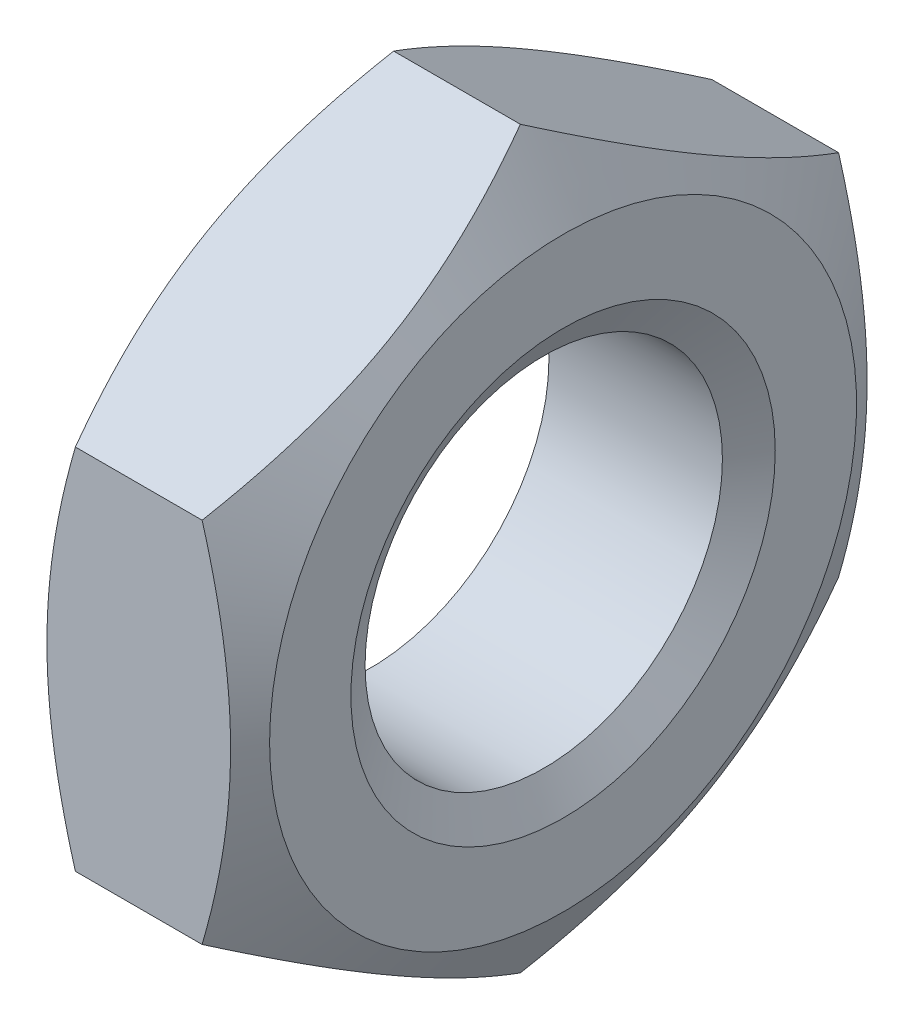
ISO-10303-21;
HEADER;
FILE_DESCRIPTION(('STEP AP214'),'2;1');
FILE_NAME('part.step','',(''),(''),'','','');
FILE_SCHEMA(('AUTOMOTIVE_DESIGN { 1 0 10303 214 1 1 1 1 }'));
ENDSEC;
DATA;
#1=APPLICATION_CONTEXT('core data for automotive mechanical design processes');
#2=APPLICATION_PROTOCOL_DEFINITION('international standard','automotive_design',2000,#1);
#3=PRODUCT_CONTEXT('',#1,'mechanical');
#4=PRODUCT('Part','Part','',(#3));
#5=PRODUCT_RELATED_PRODUCT_CATEGORY('part','',(#4));
#6=PRODUCT_DEFINITION_FORMATION('','',#4);
#7=PRODUCT_DEFINITION_CONTEXT('part definition',#1,'design');
#8=PRODUCT_DEFINITION('design','',#6,#7);
#9=PRODUCT_DEFINITION_SHAPE('','',#8);
#10=(LENGTH_UNIT() NAMED_UNIT(*) SI_UNIT(.MILLI.,.METRE.));
#11=(NAMED_UNIT(*) PLANE_ANGLE_UNIT() SI_UNIT($,.RADIAN.));
#12=(NAMED_UNIT(*) SI_UNIT($,.STERADIAN.) SOLID_ANGLE_UNIT());
#13=UNCERTAINTY_MEASURE_WITH_UNIT(LENGTH_MEASURE(1.E-05),#10,'distance_accuracy_value','');
#14=(GEOMETRIC_REPRESENTATION_CONTEXT(3) GLOBAL_UNCERTAINTY_ASSIGNED_CONTEXT((#13)) GLOBAL_UNIT_ASSIGNED_CONTEXT((#10,
#11,#12)) REPRESENTATION_CONTEXT('',''));
#15=CARTESIAN_POINT('',(0.,0.,0.));
#16=DIRECTION('',(0.,0.,1.));
#17=DIRECTION('',(1.,0.,0.));
#18=AXIS2_PLACEMENT_3D('',#15,#16,#17);
#19=CARTESIAN_POINT('',(0.,0.,0.));
#20=DIRECTION('',(1.,0.,0.));
#21=DIRECTION('',(0.,0.,-1.));
#22=AXIS2_PLACEMENT_3D('',#19,#20,#21);
#23=PLANE('',#22);
#24=CARTESIAN_POINT('',(5.6843418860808E-11,0.,0.));
#25=DIRECTION('',(-1.,0.,0.));
#26=DIRECTION('',(0.,0.,1.));
#27=AXIS2_PLACEMENT_3D('',#24,#25,#26);
#28=CIRCLE('',#27,6.00021528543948);
#29=CARTESIAN_POINT('',(5.6843418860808E-11,0.,6.00021528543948));
#30=VERTEX_POINT('',#29);
#31=EDGE_CURVE('E71',#30,#30,#28,.T.);
#32=ORIENTED_EDGE('',*,*,#31,.F.);
#33=EDGE_LOOP('',(#32));
#34=FACE_BOUND('',#33,.T.);
#35=CARTESIAN_POINT('',(0.,0.,0.));
#36=DIRECTION('',(1.,0.,0.));
#37=DIRECTION('',(0.,0.,-1.));
#38=AXIS2_PLACEMENT_3D('',#35,#36,#37);
#39=CIRCLE('',#38,8.3);
#40=CARTESIAN_POINT('',(0.,0.,-8.3));
#41=VERTEX_POINT('',#40);
#42=EDGE_CURVE('E21',#41,#41,#39,.F.);
#43=ORIENTED_EDGE('',*,*,#42,.T.);
#44=EDGE_LOOP('',(#43));
#45=FACE_BOUND('',#44,.T.);
#46=ADVANCED_FACE('F17',(#34,#45),#23,.F.);
#47=CARTESIAN_POINT('',(0.,0.,0.));
#48=DIRECTION('',(1.,0.,0.));
#49=DIRECTION('',(0.,0.,-1.));
#50=AXIS2_PLACEMENT_3D('',#47,#48,#49);
#51=CONICAL_SURFACE('',#50,8.3,1.0471975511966);
#52=CARTESIAN_POINT('',(1.2079927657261,-10.3923048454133,0.));
#53=CARTESIAN_POINT('',(1.14206327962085,-10.2781018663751,-0.197805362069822));
#54=CARTESIAN_POINT('',(1.07912551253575,-10.1634534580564,-0.396382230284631));
#55=CARTESIAN_POINT('',(0.960058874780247,-9.93322560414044,-0.795148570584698));
#56=CARTESIAN_POINT('',(0.903932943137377,-9.81764577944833,-0.995338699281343));
#57=CARTESIAN_POINT('',(0.799250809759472,-9.58534066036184,-1.39770296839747));
#58=CARTESIAN_POINT('',(0.750712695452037,-9.46861331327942,-1.59988066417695));
#59=CARTESIAN_POINT('',(0.662256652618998,-9.23436475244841,-2.00561107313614));
#60=CARTESIAN_POINT('',(0.622336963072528,-9.11684370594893,-2.20916349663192));
#61=CARTESIAN_POINT('',(0.552802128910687,-8.88398728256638,-2.61248265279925));
#62=CARTESIAN_POINT('',(0.522958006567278,-8.76866910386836,-2.81221959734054));
#63=CARTESIAN_POINT('',(0.472919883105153,-8.53751681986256,-3.21258709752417));
#64=CARTESIAN_POINT('',(0.452725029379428,-8.42168276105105,-3.41321757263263));
#65=CARTESIAN_POINT('',(0.422489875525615,-8.18981377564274,-3.81482643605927));
#66=CARTESIAN_POINT('',(0.412438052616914,-8.07377922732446,-4.01580416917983));
#67=CARTESIAN_POINT('',(0.402706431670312,-7.84160340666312,-4.41794448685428));
#68=CARTESIAN_POINT('',(0.403026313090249,-7.72546213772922,-4.6191070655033));
#69=CARTESIAN_POINT('',(0.413315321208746,-7.50834005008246,-4.99517355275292));
#70=CARTESIAN_POINT('',(0.422029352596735,-7.40734390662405,-5.1701040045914));
#71=CARTESIAN_POINT('',(0.447131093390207,-7.20558819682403,-5.51955514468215));
#72=CARTESIAN_POINT('',(0.463519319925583,-7.10482864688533,-5.69407580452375));
#73=CARTESIAN_POINT('',(0.523807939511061,-6.80294009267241,-6.21696211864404));
#74=CARTESIAN_POINT('',(0.578824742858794,-6.60234542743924,-6.56440227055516));
#75=CARTESIAN_POINT('',(0.716364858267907,-6.19902855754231,-7.26296758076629));
#76=CARTESIAN_POINT('',(0.799471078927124,-5.99635781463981,-7.61400360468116));
#77=CARTESIAN_POINT('',(0.988086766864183,-5.59403831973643,-8.31084141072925));
#78=CARTESIAN_POINT('',(1.09355194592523,-5.39438441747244,-8.65665211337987));
#79=CARTESIAN_POINT('',(1.20799276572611,-5.19615242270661,-9.00000000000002));
#80=B_SPLINE_CURVE_WITH_KNOTS('',3,(#52,#53,#54,#55,#56,#57,#58,#59,#60,#61,#62,#63,#64,#65,#66,
#67,#68,#69,#70,#71,#72,#73,#74,#75,#76,#77,#78,#79),.UNSPECIFIED.,.F.,.F.,(4,2,2,2,2,2,2,2,2,2,
2,2,2,4),(0.,0.713211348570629,1.42672933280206,2.14192304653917,2.85697048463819,
3.55445829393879,4.25188446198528,4.9485174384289,5.64512888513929,6.25151815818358,
6.8579482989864,8.07167214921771,9.31231057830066,10.5505141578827),.UNSPECIFIED.);
#81=CARTESIAN_POINT('',(1.2079927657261,-10.3923048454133,0.));
#82=VERTEX_POINT('',#81);
#83=CARTESIAN_POINT('',(1.20799276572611,-5.1961524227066,-9.00000000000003));
#84=VERTEX_POINT('',#83);
#85=EDGE_CURVE('E70',#82,#84,#80,.T.);
#86=ORIENTED_EDGE('',*,*,#85,.F.);
#87=CARTESIAN_POINT('',(1.2079927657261,-5.19615242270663,9.));
#88=CARTESIAN_POINT('',(1.14206327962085,-5.3103554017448,8.80219463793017));
#89=CARTESIAN_POINT('',(1.07912551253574,-5.42500381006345,8.60361776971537));
#90=CARTESIAN_POINT('',(0.960058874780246,-5.65523166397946,8.2048514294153));
#91=CARTESIAN_POINT('',(0.903932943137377,-5.77081148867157,8.00466130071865));
#92=CARTESIAN_POINT('',(0.799250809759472,-6.00311660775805,7.60229703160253));
#93=CARTESIAN_POINT('',(0.750712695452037,-6.11984395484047,7.40011933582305));
#94=CARTESIAN_POINT('',(0.662256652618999,-6.35409251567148,6.99438892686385));
#95=CARTESIAN_POINT('',(0.622336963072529,-6.47161356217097,6.79083650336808));
#96=CARTESIAN_POINT('',(0.552802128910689,-6.70446998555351,6.38751734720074));
#97=CARTESIAN_POINT('',(0.52295800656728,-6.81978816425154,6.18778040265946));
#98=CARTESIAN_POINT('',(0.472919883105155,-7.05094044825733,5.78741290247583));
#99=CARTESIAN_POINT('',(0.45272502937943,-7.16677450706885,5.58678242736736));
#100=CARTESIAN_POINT('',(0.422489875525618,-7.39864349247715,5.18517356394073));
#101=CARTESIAN_POINT('',(0.412438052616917,-7.51467804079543,4.98419583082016));
#102=CARTESIAN_POINT('',(0.402706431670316,-7.74685386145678,4.58205551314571));
#103=CARTESIAN_POINT('',(0.403026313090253,-7.86299513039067,4.38089293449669));
#104=CARTESIAN_POINT('',(0.41331532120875,-8.08011721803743,4.00482644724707));
#105=CARTESIAN_POINT('',(0.42202935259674,-8.18111336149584,3.8298959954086));
#106=CARTESIAN_POINT('',(0.447131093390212,-8.38286907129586,3.48044485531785));
#107=CARTESIAN_POINT('',(0.463519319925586,-8.48362862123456,3.30592419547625));
#108=CARTESIAN_POINT('',(0.523807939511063,-8.78551717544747,2.78303788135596));
#109=CARTESIAN_POINT('',(0.578824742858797,-8.98611184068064,2.43559772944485));
#110=CARTESIAN_POINT('',(0.716364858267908,-9.38942871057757,1.73703241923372));
#111=CARTESIAN_POINT('',(0.799471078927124,-9.59209945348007,1.38599639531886));
#112=CARTESIAN_POINT('',(0.98808676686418,-9.99441894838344,0.689158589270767));
#113=CARTESIAN_POINT('',(1.09355194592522,-10.1940728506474,0.343347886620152));
#114=CARTESIAN_POINT('',(1.2079927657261,-10.3923048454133,0.));
#115=B_SPLINE_CURVE_WITH_KNOTS('',3,(#87,#88,#89,#90,#91,#92,#93,#94,#95,#96,#97,#98,#99,#100,
#101,#102,#103,#104,#105,#106,#107,#108,#109,#110,#111,#112,#113,#114),.UNSPECIFIED.,.F.,.F.,(4,
2,2,2,2,2,2,2,2,2,2,2,2,4),(0.,0.71321134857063,1.42672933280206,2.14192304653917,
2.85697048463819,3.55445829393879,4.25188446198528,4.9485174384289,5.64512888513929,
6.25151815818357,6.85794829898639,8.07167214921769,9.31231057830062,10.5505141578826),.UNSPECIFIED.);
#116=CARTESIAN_POINT('',(1.2079927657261,-5.19615242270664,9.));
#117=VERTEX_POINT('',#116);
#118=EDGE_CURVE('E62',#117,#82,#115,.T.);
#119=ORIENTED_EDGE('',*,*,#118,.F.);
#120=CARTESIAN_POINT('',(1.2079927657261,5.19615242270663,9.));
#121=CARTESIAN_POINT('',(1.14206327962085,4.9677464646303,9.));
#122=CARTESIAN_POINT('',(1.07912551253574,4.738449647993,9.));
#123=CARTESIAN_POINT('',(0.960058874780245,4.27799394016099,9.));
#124=CARTESIAN_POINT('',(0.903932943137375,4.04683429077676,9.));
#125=CARTESIAN_POINT('',(0.799250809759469,3.5822240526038,9.));
#126=CARTESIAN_POINT('',(0.750712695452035,3.34876935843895,9.));
#127=CARTESIAN_POINT('',(0.662256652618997,2.88027223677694,9.));
#128=CARTESIAN_POINT('',(0.622336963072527,2.64523014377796,9.));
#129=CARTESIAN_POINT('',(0.552802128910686,2.17951729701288,9.));
#130=CARTESIAN_POINT('',(0.522958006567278,1.94888093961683,9.));
#131=CARTESIAN_POINT('',(0.472919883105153,1.48657637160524,9.));
#132=CARTESIAN_POINT('',(0.452725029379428,1.25490825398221,9.));
#133=CARTESIAN_POINT('',(0.422489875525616,0.79117028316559,9.));
#134=CARTESIAN_POINT('',(0.412438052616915,0.559101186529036,9.));
#135=CARTESIAN_POINT('',(0.402706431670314,0.0947495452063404,9.));
#136=CARTESIAN_POINT('',(0.403026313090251,-0.137532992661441,9.));
#137=CARTESIAN_POINT('',(0.413315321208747,-0.571777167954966,9.));
#138=CARTESIAN_POINT('',(0.422029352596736,-0.773769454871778,9.));
#139=CARTESIAN_POINT('',(0.447131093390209,-1.17728087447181,9.));
#140=CARTESIAN_POINT('',(0.463519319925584,-1.37879997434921,9.));
#141=CARTESIAN_POINT('',(0.523807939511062,-1.98257708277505,9.));
#142=CARTESIAN_POINT('',(0.578824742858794,-2.38376641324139,9.));
#143=CARTESIAN_POINT('',(0.716364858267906,-3.19040015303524,9.));
#144=CARTESIAN_POINT('',(0.799471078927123,-3.59574163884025,9.));
#145=CARTESIAN_POINT('',(0.988086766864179,-4.400380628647,9.));
#146=CARTESIAN_POINT('',(1.09355194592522,-4.79968843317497,9.));
#147=CARTESIAN_POINT('',(1.2079927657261,-5.19615242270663,9.));
#148=B_SPLINE_CURVE_WITH_KNOTS('',3,(#120,#121,#122,#123,#124,#125,#126,#127,#128,#129,#130,
#131,#132,#133,#134,#135,#136,#137,#138,#139,#140,#141,#142,#143,#144,#145,#146,#147),
.UNSPECIFIED.,.F.,.F.,(4,2,2,2,2,2,2,2,2,2,2,2,2,4),(0.,0.713211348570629,1.42672933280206,
2.14192304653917,2.85697048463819,3.55445829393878,4.25188446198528,4.9485174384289,
5.64512888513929,6.25151815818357,6.85794829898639,8.07167214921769,9.31231057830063,
10.5505141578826),.UNSPECIFIED.);
#149=CARTESIAN_POINT('',(1.2079927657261,5.19615242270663,8.99999999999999));
#150=VERTEX_POINT('',#149);
#151=EDGE_CURVE('E67',#150,#117,#148,.T.);
#152=ORIENTED_EDGE('',*,*,#151,.F.);
#153=CARTESIAN_POINT('',(1.2079927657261,10.3923048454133,0.));
#154=CARTESIAN_POINT('',(1.14206327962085,10.2781018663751,0.197805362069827));
#155=CARTESIAN_POINT('',(1.07912551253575,10.1634534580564,0.396382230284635));
#156=CARTESIAN_POINT('',(0.960058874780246,9.93322560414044,0.795148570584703));
#157=CARTESIAN_POINT('',(0.903932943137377,9.81764577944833,0.995338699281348));
#158=CARTESIAN_POINT('',(0.799250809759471,9.58534066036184,1.39770296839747));
#159=CARTESIAN_POINT('',(0.750712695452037,9.46861331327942,1.59988066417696));
#160=CARTESIAN_POINT('',(0.662256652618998,9.23436475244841,2.00561107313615));
#161=CARTESIAN_POINT('',(0.622336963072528,9.11684370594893,2.20916349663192));
#162=CARTESIAN_POINT('',(0.552802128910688,8.88398728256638,2.61248265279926));
#163=CARTESIAN_POINT('',(0.522958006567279,8.76866910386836,2.81221959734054));
#164=CARTESIAN_POINT('',(0.472919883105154,8.53751681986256,3.21258709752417));
#165=CARTESIAN_POINT('',(0.452725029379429,8.42168276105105,3.41321757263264));
#166=CARTESIAN_POINT('',(0.422489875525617,8.18981377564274,3.81482643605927));
#167=CARTESIAN_POINT('',(0.412438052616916,8.07377922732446,4.01580416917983));
#168=CARTESIAN_POINT('',(0.402706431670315,7.84160340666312,4.41794448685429));
#169=CARTESIAN_POINT('',(0.403026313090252,7.72546213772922,4.61910706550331));
#170=CARTESIAN_POINT('',(0.413315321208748,7.50834005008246,4.99517355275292));
#171=CARTESIAN_POINT('',(0.422029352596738,7.40734390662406,5.1701040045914));
#172=CARTESIAN_POINT('',(0.44713109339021,7.20558819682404,5.51955514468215));
#173=CARTESIAN_POINT('',(0.463519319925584,7.10482864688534,5.69407580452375));
#174=CARTESIAN_POINT('',(0.523807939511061,6.80294009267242,6.21696211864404));
#175=CARTESIAN_POINT('',(0.578824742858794,6.60234542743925,6.56440227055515));
#176=CARTESIAN_POINT('',(0.716364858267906,6.19902855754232,7.26296758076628));
#177=CARTESIAN_POINT('',(0.799471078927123,5.99635781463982,7.61400360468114));
#178=CARTESIAN_POINT('',(0.98808676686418,5.59403831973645,8.31084141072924));
#179=CARTESIAN_POINT('',(1.09355194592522,5.39438441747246,8.65665211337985));
#180=CARTESIAN_POINT('',(1.2079927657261,5.19615242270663,9.));
#181=B_SPLINE_CURVE_WITH_KNOTS('',3,(#153,#154,#155,#156,#157,#158,#159,#160,#161,#162,#163,
#164,#165,#166,#167,#168,#169,#170,#171,#172,#173,#174,#175,#176,#177,#178,#179,#180),
.UNSPECIFIED.,.F.,.F.,(4,2,2,2,2,2,2,2,2,2,2,2,2,4),(0.,0.713211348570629,1.42672933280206,
2.14192304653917,2.85697048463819,3.55445829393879,4.25188446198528,4.9485174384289,
5.64512888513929,6.25151815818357,6.85794829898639,8.07167214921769,9.31231057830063,
10.5505141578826),.UNSPECIFIED.);
#182=CARTESIAN_POINT('',(1.2079927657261,10.3923048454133,0.));
#183=VERTEX_POINT('',#182);
#184=EDGE_CURVE('E81',#183,#150,#181,.T.);
#185=ORIENTED_EDGE('',*,*,#184,.F.);
#186=CARTESIAN_POINT('',(1.20799276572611,5.19615242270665,-9.));
#187=CARTESIAN_POINT('',(1.14206327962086,5.31035540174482,-8.80219463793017));
#188=CARTESIAN_POINT('',(1.07912551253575,5.42500381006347,-8.60361776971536));
#189=CARTESIAN_POINT('',(0.960058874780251,5.65523166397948,-8.20485142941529));
#190=CARTESIAN_POINT('',(0.903932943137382,5.77081148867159,-8.00466130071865));
#191=CARTESIAN_POINT('',(0.799250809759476,6.00311660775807,-7.60229703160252));
#192=CARTESIAN_POINT('',(0.750712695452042,6.11984395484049,-7.40011933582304));
#193=CARTESIAN_POINT('',(0.662256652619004,6.3540925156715,-6.99438892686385));
#194=CARTESIAN_POINT('',(0.622336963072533,6.47161356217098,-6.79083650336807));
#195=CARTESIAN_POINT('',(0.552802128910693,6.70446998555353,-6.38751734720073));
#196=CARTESIAN_POINT('',(0.522958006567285,6.81978816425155,-6.18778040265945));
#197=CARTESIAN_POINT('',(0.47291988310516,7.05094044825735,-5.78741290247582));
#198=CARTESIAN_POINT('',(0.452725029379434,7.16677450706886,-5.58678242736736));
#199=CARTESIAN_POINT('',(0.422489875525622,7.39864349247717,-5.18517356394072));
#200=CARTESIAN_POINT('',(0.412438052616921,7.51467804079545,-4.98419583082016));
#201=CARTESIAN_POINT('',(0.402706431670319,7.74685386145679,-4.5820555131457));
#202=CARTESIAN_POINT('',(0.403026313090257,7.86299513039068,-4.38089293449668));
#203=CARTESIAN_POINT('',(0.413315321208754,8.08011721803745,-4.00482644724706));
#204=CARTESIAN_POINT('',(0.422029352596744,8.18111336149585,-3.82989599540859));
#205=CARTESIAN_POINT('',(0.447131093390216,8.38286907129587,-3.48044485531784));
#206=CARTESIAN_POINT('',(0.46351931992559,8.48362862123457,-3.30592419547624));
#207=CARTESIAN_POINT('',(0.523807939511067,8.78551717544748,-2.78303788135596));
#208=CARTESIAN_POINT('',(0.5788247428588,8.98611184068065,-2.43559772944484));
#209=CARTESIAN_POINT('',(0.716364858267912,9.38942871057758,-1.73703241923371));
#210=CARTESIAN_POINT('',(0.799471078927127,9.59209945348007,-1.38599639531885));
#211=CARTESIAN_POINT('',(0.988086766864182,9.99441894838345,-0.68915858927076));
#212=CARTESIAN_POINT('',(1.09355194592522,10.1940728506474,-0.343347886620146));
#213=CARTESIAN_POINT('',(1.2079927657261,10.3923048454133,0.));
#214=B_SPLINE_CURVE_WITH_KNOTS('',3,(#186,#187,#188,#189,#190,#191,#192,#193,#194,#195,#196,
#197,#198,#199,#200,#201,#202,#203,#204,#205,#206,#207,#208,#209,#210,#211,#212,#213),
.UNSPECIFIED.,.F.,.F.,(4,2,2,2,2,2,2,2,2,2,2,2,2,4),(0.,0.713211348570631,1.42672933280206,
2.14192304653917,2.85697048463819,3.55445829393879,4.25188446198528,4.9485174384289,
5.64512888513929,6.25151815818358,6.85794829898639,8.07167214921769,9.31231057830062,
10.5505141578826),.UNSPECIFIED.);
#215=CARTESIAN_POINT('',(1.20799276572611,5.19615242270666,-9.));
#216=VERTEX_POINT('',#215);
#217=EDGE_CURVE('E175',#216,#183,#214,.T.);
#218=ORIENTED_EDGE('',*,*,#217,.F.);
#219=CARTESIAN_POINT('',(1.20799276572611,-5.1961524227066,-9.00000000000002));
#220=CARTESIAN_POINT('',(1.14206327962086,-4.96774646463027,-9.00000000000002));
#221=CARTESIAN_POINT('',(1.07912551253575,-4.73844964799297,-9.00000000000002));
#222=CARTESIAN_POINT('',(0.960058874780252,-4.27799394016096,-9.00000000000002));
#223=CARTESIAN_POINT('',(0.903932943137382,-4.04683429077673,-9.00000000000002));
#224=CARTESIAN_POINT('',(0.799250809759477,-3.58222405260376,-9.00000000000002));
#225=CARTESIAN_POINT('',(0.750712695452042,-3.34876935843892,-9.00000000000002));
#226=CARTESIAN_POINT('',(0.662256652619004,-2.8802722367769,-9.00000000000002));
#227=CARTESIAN_POINT('',(0.622336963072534,-2.64523014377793,-9.00000000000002));
#228=CARTESIAN_POINT('',(0.552802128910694,-2.17951729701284,-9.00000000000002));
#229=CARTESIAN_POINT('',(0.522958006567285,-1.94888093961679,-9.00000000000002));
#230=CARTESIAN_POINT('',(0.472919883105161,-1.4865763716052,-9.00000000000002));
#231=CARTESIAN_POINT('',(0.452725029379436,-1.25490825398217,-9.00000000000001));
#232=CARTESIAN_POINT('',(0.422489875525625,-0.791170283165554,-9.00000000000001));
#233=CARTESIAN_POINT('',(0.412438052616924,-0.559101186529,-9.00000000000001));
#234=CARTESIAN_POINT('',(0.402706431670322,-0.0947495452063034,-9.00000000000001));
#235=CARTESIAN_POINT('',(0.40302631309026,0.137532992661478,-9.00000000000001));
#236=CARTESIAN_POINT('',(0.413315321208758,0.571777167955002,-9.00000000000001));
#237=CARTESIAN_POINT('',(0.422029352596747,0.773769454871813,-9.00000000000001));
#238=CARTESIAN_POINT('',(0.447131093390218,1.17728087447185,-9.00000000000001));
#239=CARTESIAN_POINT('',(0.463519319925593,1.37879997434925,-9.00000000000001));
#240=CARTESIAN_POINT('',(0.52380793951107,1.98257708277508,-9.00000000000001));
#241=CARTESIAN_POINT('',(0.578824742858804,2.38376641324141,-9.00000000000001));
#242=CARTESIAN_POINT('',(0.716364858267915,3.19040015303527,-9.));
#243=CARTESIAN_POINT('',(0.799471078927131,3.59574163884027,-9.));
#244=CARTESIAN_POINT('',(0.988086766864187,4.40038062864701,-9.));
#245=CARTESIAN_POINT('',(1.09355194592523,4.79968843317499,-9.));
#246=CARTESIAN_POINT('',(1.20799276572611,5.19615242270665,-9.));
#247=B_SPLINE_CURVE_WITH_KNOTS('',3,(#219,#220,#221,#222,#223,#224,#225,#226,#227,#228,#229,
#230,#231,#232,#233,#234,#235,#236,#237,#238,#239,#240,#241,#242,#243,#244,#245,#246),
.UNSPECIFIED.,.F.,.F.,(4,2,2,2,2,2,2,2,2,2,2,2,2,4),(0.,0.713211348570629,1.42672933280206,
2.14192304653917,2.85697048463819,3.55445829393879,4.25188446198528,4.94851743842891,
5.64512888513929,6.25151815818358,6.85794829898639,8.07167214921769,9.31231057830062,
10.5505141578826),.UNSPECIFIED.);
#248=EDGE_CURVE('E169',#84,#216,#247,.T.);
#249=ORIENTED_EDGE('',*,*,#248,.F.);
#250=EDGE_LOOP('',(#86,#119,#152,#185,#218,#249));
#251=FACE_BOUND('',#250,.T.);
#252=ORIENTED_EDGE('',*,*,#42,.F.);
#253=EDGE_LOOP('',(#252));
#254=FACE_BOUND('',#253,.T.);
#255=ADVANCED_FACE('F64',(#251,#254),#51,.T.);
#256=CARTESIAN_POINT('',(0.54687500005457,0.,0.));
#257=DIRECTION('',(-1.,0.,0.));
#258=DIRECTION('',(0.,0.,1.));
#259=AXIS2_PLACEMENT_3D('',#256,#257,#258);
#260=CONICAL_SURFACE('',#259,5.05300000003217,1.04719755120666);
#261=ORIENTED_EDGE('',*,*,#31,.T.);
#262=EDGE_LOOP('',(#261));
#263=FACE_BOUND('',#262,.T.);
#264=CARTESIAN_POINT('',(0.546874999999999,0.,0.));
#265=DIRECTION('',(1.,0.,0.));
#266=DIRECTION('',(0.,0.,-1.));
#267=AXIS2_PLACEMENT_3D('',#264,#265,#266);
#268=CIRCLE('',#267,5.053);
#269=CARTESIAN_POINT('',(0.546874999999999,0.,-5.053));
#270=VERTEX_POINT('',#269);
#271=EDGE_CURVE('E208',#270,#270,#268,.T.);
#272=ORIENTED_EDGE('',*,*,#271,.T.);
#273=EDGE_LOOP('',(#272));
#274=FACE_BOUND('',#273,.T.);
#275=ADVANCED_FACE('F217',(#263,#274),#260,.F.);
#276=CARTESIAN_POINT('',(0.,-10.3923048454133,0.));
#277=DIRECTION('',(0.,-0.866025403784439,0.5));
#278=DIRECTION('',(0.,-0.5,-0.866025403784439));
#279=AXIS2_PLACEMENT_3D('',#276,#277,#278);
#280=PLANE('',#279);
#281=CARTESIAN_POINT('',(4.7920072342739,-10.3923048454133,0.));
#282=CARTESIAN_POINT('',(4.8579367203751,-10.2781018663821,0.197805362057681));
#283=CARTESIAN_POINT('',(4.92087448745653,-10.1634534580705,0.39638223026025));
#284=CARTESIAN_POINT('',(5.03994112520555,-9.93322560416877,0.795148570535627));
#285=CARTESIAN_POINT('',(5.09606705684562,-9.81764577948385,0.995338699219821));
#286=CARTESIAN_POINT('',(5.20074919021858,-9.58534066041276,1.39770296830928));
#287=CARTESIAN_POINT('',(5.24928730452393,-9.46861331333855,1.59988066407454));
#288=CARTESIAN_POINT('',(5.33774334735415,-9.23436475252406,2.00561107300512));
#289=CARTESIAN_POINT('',(5.37766303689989,-9.11684370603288,2.20916349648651));
#290=CARTESIAN_POINT('',(5.44719787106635,-8.88398728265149,2.61248265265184));
#291=CARTESIAN_POINT('',(5.47704199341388,-8.76866910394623,2.81221959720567));
#292=CARTESIAN_POINT('',(5.52708011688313,-8.53751681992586,3.21258709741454));
#293=CARTESIAN_POINT('',(5.54727497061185,-8.42168276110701,3.41321757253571));
#294=CARTESIAN_POINT('',(5.57751012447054,-8.18981377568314,3.8148264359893));
#295=CARTESIAN_POINT('',(5.58756194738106,-8.07377922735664,4.01580416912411));
#296=CARTESIAN_POINT('',(5.5972935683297,-7.841603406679,4.41794448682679));
#297=CARTESIAN_POINT('',(5.59697368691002,-7.72546213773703,4.61910706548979));
#298=CARTESIAN_POINT('',(5.58668467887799,-7.50834005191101,4.99517354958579));
#299=CARTESIAN_POINT('',(5.57797064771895,-7.40734391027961,5.1701039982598));
#300=CARTESIAN_POINT('',(5.55286890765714,-7.20558820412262,5.51955513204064));
#301=CARTESIAN_POINT('',(5.53648068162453,-7.10482865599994,5.6940757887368));
#302=CARTESIAN_POINT('',(5.47619206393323,-6.80294010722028,6.21696209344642));
#303=CARTESIAN_POINT('',(5.42117526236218,-6.60234544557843,6.56440223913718));
#304=CARTESIAN_POINT('',(5.28363515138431,-6.19902858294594,7.26296753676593));
#305=CARTESIAN_POINT('',(5.20052893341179,-5.99635784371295,7.61400355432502));
#306=CARTESIAN_POINT('',(5.01191325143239,-5.59403835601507,8.31084134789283));
#307=CARTESIAN_POINT('',(4.90644807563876,-5.39438445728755,8.6566520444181));
#308=CARTESIAN_POINT('',(4.7920072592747,-5.1961524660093,8.99999992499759));
#309=B_SPLINE_CURVE_WITH_KNOTS('',3,(#281,#282,#283,#284,#285,#286,#287,#288,#289,#290,#291,
#292,#293,#294,#295,#296,#297,#298,#299,#300,#301,#302,#303,#304,#305,#306,#307,#308),
.UNSPECIFIED.,.F.,.F.,(4,2,2,2,2,2,2,2,2,2,2,2,2,4),(0.,0.713211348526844,1.4267293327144,
2.14192304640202,2.8569704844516,3.55445829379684,4.25188446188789,4.94851743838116,
5.64512888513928,6.25151814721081,6.85794827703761,8.07167210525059,9.31231051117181,
10.5505140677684),.UNSPECIFIED.);
#310=CARTESIAN_POINT('',(4.7920072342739,-10.3923048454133,0.));
#311=VERTEX_POINT('',#310);
#312=CARTESIAN_POINT('',(4.7920072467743,-5.19615244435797,8.99999996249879));
#313=VERTEX_POINT('',#312);
#314=EDGE_CURVE('E77',#311,#313,#309,.T.);
#315=ORIENTED_EDGE('',*,*,#314,.T.);
#316=DIRECTION('',(1.,0.,0.));
#317=VECTOR('',#316,1.);
#318=CARTESIAN_POINT('',(0.,-5.19615242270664,9.));
#319=LINE('',#318,#317);
#320=EDGE_CURVE('E74',#117,#313,#319,.T.);
#321=ORIENTED_EDGE('',*,*,#320,.F.);
#322=ORIENTED_EDGE('',*,*,#118,.T.);
#323=DIRECTION('',(1.,0.,0.));
#324=VECTOR('',#323,1.);
#325=CARTESIAN_POINT('',(0.,-10.3923048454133,0.));
#326=LINE('',#325,#324);
#327=EDGE_CURVE('E36',#311,#82,#326,.F.);
#328=ORIENTED_EDGE('',*,*,#327,.F.);
#329=EDGE_LOOP('',(#315,#321,#322,#328));
#330=FACE_BOUND('',#329,.T.);
#331=ADVANCED_FACE('F75',(#330),#280,.T.);
#332=CARTESIAN_POINT('',(0.,-5.19615242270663,9.));
#333=DIRECTION('',(0.,0.,1.));
#334=DIRECTION('',(1.,0.,0.));
#335=AXIS2_PLACEMENT_3D('',#332,#333,#334);
#336=PLANE('',#335);
#337=CARTESIAN_POINT('',(4.79200722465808,-5.1961524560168,9.));
#338=CARTESIAN_POINT('',(4.8579367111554,-4.96774649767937,9.));
#339=CARTESIAN_POINT('',(4.92087447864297,-4.73844968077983,9.));
#340=CARTESIAN_POINT('',(5.0399411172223,-4.27799397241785,9.));
#341=CARTESIAN_POINT('',(5.09606704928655,-4.04683432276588,9.));
#342=CARTESIAN_POINT('',(5.20074918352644,-3.58222408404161,9.));
#343=CARTESIAN_POINT('',(5.2492872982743,-3.34876938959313,9.));
#344=CARTESIAN_POINT('',(5.33774334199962,-2.88027226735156,9.));
#345=CARTESIAN_POINT('',(5.37766303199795,-2.64523017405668,9.));
#346=CARTESIAN_POINT('',(5.44719786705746,-2.17951732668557,9.));
#347=CARTESIAN_POINT('',(5.47704198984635,-1.94888096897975,9.));
#348=CARTESIAN_POINT('',(5.52708011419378,-1.48657640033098,9.));
#349=CARTESIAN_POINT('',(5.54727496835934,-1.25490828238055,9.));
#350=CARTESIAN_POINT('',(5.57751012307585,-0.791170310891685,9.));
#351=CARTESIAN_POINT('',(5.5875619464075,-0.559101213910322,9.));
#352=CARTESIAN_POINT('',(5.59729356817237,-0.0947495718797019,9.));
#353=CARTESIAN_POINT('',(5.59697368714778,0.137532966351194,9.));
#354=CARTESIAN_POINT('',(5.58668467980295,0.571777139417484,9.));
#355=CARTESIAN_POINT('',(5.57797064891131,0.77376942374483,9.));
#356=CARTESIAN_POINT('',(5.55286890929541,1.17728083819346,9.));
#357=CARTESIAN_POINT('',(5.53648068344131,1.37879993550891,9.));
#358=CARTESIAN_POINT('',(5.47619206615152,1.98257703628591,9.));
#359=CARTESIAN_POINT('',(5.42117526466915,2.38376636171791,9.));
#360=CARTESIAN_POINT('',(5.28363515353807,3.19040009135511,9.));
#361=CARTESIAN_POINT('',(5.20052893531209,3.59574157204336,9.));
#362=CARTESIAN_POINT('',(5.01191325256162,4.40038055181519,9.));
#363=CARTESIAN_POINT('',(4.90644807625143,4.79968835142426,9.));
#364=CARTESIAN_POINT('',(4.7920072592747,5.1961523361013,9.));
#365=B_SPLINE_CURVE_WITH_KNOTS('',3,(#337,#338,#339,#340,#341,#342,#343,#344,#345,#346,#347,
#348,#349,#350,#351,#352,#353,#354,#355,#356,#357,#358,#359,#360,#361,#362,#363,#364),
.UNSPECIFIED.,.F.,.F.,(4,2,2,2,2,2,2,2,2,2,2,2,2,4),(0.,0.713211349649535,1.42672933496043,
2.14192304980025,2.85697048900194,3.55445829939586,4.25188446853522,4.9485174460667,
5.64512889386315,6.25151815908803,6.85794829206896,8.0716721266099,9.31231053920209,
10.5505141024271),.UNSPECIFIED.);
#366=CARTESIAN_POINT('',(4.7920072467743,5.19615237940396,8.99999999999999));
#367=VERTEX_POINT('',#366);
#368=EDGE_CURVE('E114',#313,#367,#365,.T.);
#369=ORIENTED_EDGE('',*,*,#368,.T.);
#370=DIRECTION('',(1.,0.,0.));
#371=VECTOR('',#370,1.);
#372=CARTESIAN_POINT('',(0.,5.19615242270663,8.99999999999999));
#373=LINE('',#372,#371);
#374=EDGE_CURVE('E85',#150,#367,#373,.T.);
#375=ORIENTED_EDGE('',*,*,#374,.F.);
#376=ORIENTED_EDGE('',*,*,#151,.T.);
#377=ORIENTED_EDGE('',*,*,#320,.T.);
#378=EDGE_LOOP('',(#369,#375,#376,#377));
#379=FACE_BOUND('',#378,.T.);
#380=ADVANCED_FACE('F83',(#379),#336,.T.);
#381=CARTESIAN_POINT('',(0.,5.19615242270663,9.));
#382=DIRECTION('',(0.,0.866025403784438,0.500000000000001));
#383=DIRECTION('',(0.,-0.500000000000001,0.866025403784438));
#384=AXIS2_PLACEMENT_3D('',#381,#382,#383);
#385=PLANE('',#384);
#386=CARTESIAN_POINT('',(4.79200722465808,5.19615240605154,9.00000002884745));
#387=CARTESIAN_POINT('',(4.85793671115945,5.31035538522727,8.80219466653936));
#388=CARTESIAN_POINT('',(4.9208744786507,5.42500379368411,8.60361779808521));
#389=CARTESIAN_POINT('',(5.03994111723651,5.65523164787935,8.20485145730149));
#390=CARTESIAN_POINT('',(5.09606704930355,5.77081147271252,8.00466132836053));
#391=CARTESIAN_POINT('',(5.20074918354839,6.00311659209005,7.60229705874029));
#392=CARTESIAN_POINT('',(5.24928729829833,6.11984393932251,7.40011936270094));
#393=CARTESIAN_POINT('',(5.33774334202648,6.35409250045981,6.99438895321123));
#394=CARTESIAN_POINT('',(5.37766303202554,6.47161354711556,6.79083652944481));
#395=CARTESIAN_POINT('',(5.44719786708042,6.70446997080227,6.38751737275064));
#396=CARTESIAN_POINT('',(5.47704198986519,6.81978814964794,6.18778042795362));
#397=CARTESIAN_POINT('',(5.5270801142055,7.05094043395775,5.78741292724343));
#398=CARTESIAN_POINT('',(5.54727496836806,7.16677449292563,5.58678245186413));
#399=CARTESIAN_POINT('',(5.5775101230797,7.3986434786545,5.18517358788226));
#400=CARTESIAN_POINT('',(5.58756194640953,7.51467802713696,4.98419585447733));
#401=CARTESIAN_POINT('',(5.59729356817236,7.74685384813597,4.58205553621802));
#402=CARTESIAN_POINT('',(5.59697368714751,7.86299511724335,4.38089295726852));
#403=CARTESIAN_POINT('',(5.58668467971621,8.08011720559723,4.00482646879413));
#404=CARTESIAN_POINT('',(5.57797064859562,8.18111334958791,3.82989601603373));
#405=CARTESIAN_POINT('',(5.55286890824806,8.38286906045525,3.48044487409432));
#406=CARTESIAN_POINT('',(5.53648068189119,8.48362861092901,3.30592421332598));
#407=CARTESIAN_POINT('',(5.47619206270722,8.78551716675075,2.78303789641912));
#408=CARTESIAN_POINT('',(5.42117525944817,8.98611183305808,2.4355977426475));
#409=CARTESIAN_POINT('',(5.28363514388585,9.38942870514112,1.73703242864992));
#410=CARTESIAN_POINT('',(5.20052892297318,9.59209944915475,1.38599640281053));
#411=CARTESIAN_POINT('',(5.01191323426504,9.99441894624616,0.689158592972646));
#412=CARTESIAN_POINT('',(4.90644805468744,10.1940728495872,0.34334788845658));
#413=CARTESIAN_POINT('',(4.7920072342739,10.3923048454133,0.));
#414=B_SPLINE_CURVE_WITH_KNOTS('',3,(#386,#387,#388,#389,#390,#391,#392,#393,#394,#395,#396,
#397,#398,#399,#400,#401,#402,#403,#404,#405,#406,#407,#408,#409,#410,#411,#412,#413),
.UNSPECIFIED.,.F.,.F.,(4,2,2,2,2,2,2,2,2,2,2,2,2,4),(0.,0.71321134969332,1.42672933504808,
2.1419230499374,2.85697048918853,3.55445829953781,4.25188446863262,4.94851744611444,
5.64512889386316,6.25151817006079,6.85794831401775,8.07167217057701,9.31231060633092,
10.5505141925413),.UNSPECIFIED.);
#415=CARTESIAN_POINT('',(4.7920072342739,10.3923048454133,0.));
#416=VERTEX_POINT('',#415);
#417=EDGE_CURVE('E121',#367,#416,#414,.T.);
#418=ORIENTED_EDGE('',*,*,#417,.T.);
#419=DIRECTION('',(1.,0.,0.));
#420=VECTOR('',#419,1.);
#421=CARTESIAN_POINT('',(0.,10.3923048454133,0.));
#422=LINE('',#421,#420);
#423=EDGE_CURVE('E174',#183,#416,#422,.T.);
#424=ORIENTED_EDGE('',*,*,#423,.F.);
#425=ORIENTED_EDGE('',*,*,#184,.T.);
#426=ORIENTED_EDGE('',*,*,#374,.T.);
#427=EDGE_LOOP('',(#418,#424,#425,#426));
#428=FACE_BOUND('',#427,.T.);
#429=ADVANCED_FACE('F108',(#428),#385,.T.);
#430=CARTESIAN_POINT('',(0.,10.3923048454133,0.));
#431=DIRECTION('',(0.,0.866025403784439,-0.499999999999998));
#432=DIRECTION('',(0.,0.499999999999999,0.86602540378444));
#433=AXIS2_PLACEMENT_3D('',#430,#431,#432);
#434=PLANE('',#433);
#435=CARTESIAN_POINT('',(4.7920072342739,10.3923048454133,0.));
#436=CARTESIAN_POINT('',(4.8579367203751,10.2781018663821,-0.197805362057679));
#437=CARTESIAN_POINT('',(4.92087448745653,10.1634534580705,-0.396382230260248));
#438=CARTESIAN_POINT('',(5.03994112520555,9.93322560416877,-0.795148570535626));
#439=CARTESIAN_POINT('',(5.09606705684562,9.81764577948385,-0.99533869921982));
#440=CARTESIAN_POINT('',(5.20074919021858,9.58534066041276,-1.39770296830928));
#441=CARTESIAN_POINT('',(5.24928730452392,9.46861331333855,-1.59988066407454));
#442=CARTESIAN_POINT('',(5.33774334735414,9.23436475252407,-2.00561107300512));
#443=CARTESIAN_POINT('',(5.37766303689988,9.11684370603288,-2.20916349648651));
#444=CARTESIAN_POINT('',(5.44719787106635,8.8839872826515,-2.61248265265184));
#445=CARTESIAN_POINT('',(5.47704199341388,8.76866910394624,-2.81221959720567));
#446=CARTESIAN_POINT('',(5.52708011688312,8.53751681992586,-3.21258709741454));
#447=CARTESIAN_POINT('',(5.54727497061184,8.42168276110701,-3.41321757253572));
#448=CARTESIAN_POINT('',(5.57751012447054,8.18981377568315,-3.8148264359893));
#449=CARTESIAN_POINT('',(5.58756194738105,8.07377922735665,-4.01580416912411));
#450=CARTESIAN_POINT('',(5.5972935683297,7.841603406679,-4.41794448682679));
#451=CARTESIAN_POINT('',(5.59697368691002,7.72546213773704,-4.61910706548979));
#452=CARTESIAN_POINT('',(5.58668467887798,7.50834005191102,-4.99517354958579));
#453=CARTESIAN_POINT('',(5.57797064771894,7.40734391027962,-5.1701039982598));
#454=CARTESIAN_POINT('',(5.55286890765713,7.20558820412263,-5.51955513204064));
#455=CARTESIAN_POINT('',(5.53648068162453,7.10482865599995,-5.6940757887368));
#456=CARTESIAN_POINT('',(5.47619206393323,6.80294010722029,-6.21696209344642));
#457=CARTESIAN_POINT('',(5.42117526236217,6.60234544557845,-6.56440223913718));
#458=CARTESIAN_POINT('',(5.2836351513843,6.19902858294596,-7.26296753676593));
#459=CARTESIAN_POINT('',(5.20052893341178,5.99635784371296,-7.61400355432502));
#460=CARTESIAN_POINT('',(5.01191325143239,5.59403835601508,-8.31084134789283));
#461=CARTESIAN_POINT('',(4.90644807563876,5.39438445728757,-8.6566520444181));
#462=CARTESIAN_POINT('',(4.79200725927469,5.19615246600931,-8.99999992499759));
#463=B_SPLINE_CURVE_WITH_KNOTS('',3,(#435,#436,#437,#438,#439,#440,#441,#442,#443,#444,#445,
#446,#447,#448,#449,#450,#451,#452,#453,#454,#455,#456,#457,#458,#459,#460,#461,#462),
.UNSPECIFIED.,.F.,.F.,(4,2,2,2,2,2,2,2,2,2,2,2,2,4),(0.,0.713211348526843,1.4267293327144,
2.14192304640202,2.8569704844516,3.55445829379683,4.25188446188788,4.94851743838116,
5.64512888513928,6.25151814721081,6.8579482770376,8.07167210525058,9.3123105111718,
10.5505140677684),.UNSPECIFIED.);
#464=CARTESIAN_POINT('',(4.79200724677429,5.19615244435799,-8.99999996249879));
#465=VERTEX_POINT('',#464);
#466=EDGE_CURVE('E185',#416,#465,#463,.T.);
#467=ORIENTED_EDGE('',*,*,#466,.T.);
#468=DIRECTION('',(1.,0.,0.));
#469=VECTOR('',#468,1.);
#470=CARTESIAN_POINT('',(0.,5.19615242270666,-9.));
#471=LINE('',#470,#469);
#472=EDGE_CURVE('E168',#216,#465,#471,.T.);
#473=ORIENTED_EDGE('',*,*,#472,.F.);
#474=ORIENTED_EDGE('',*,*,#217,.T.);
#475=ORIENTED_EDGE('',*,*,#423,.T.);
#476=EDGE_LOOP('',(#467,#473,#474,#475));
#477=FACE_BOUND('',#476,.T.);
#478=ADVANCED_FACE('F180',(#477),#434,.T.);
#479=CARTESIAN_POINT('',(0.,5.19615242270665,-9.));
#480=DIRECTION('',(0.,0.,-1.));
#481=DIRECTION('',(0.,1.,0.));
#482=AXIS2_PLACEMENT_3D('',#479,#480,#481);
#483=PLANE('',#482);
#484=CARTESIAN_POINT('',(4.79200722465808,5.19615245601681,-9.));
#485=CARTESIAN_POINT('',(4.8579367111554,4.96774649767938,-9.));
#486=CARTESIAN_POINT('',(4.92087447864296,4.73844968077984,-9.));
#487=CARTESIAN_POINT('',(5.0399411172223,4.27799397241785,-9.));
#488=CARTESIAN_POINT('',(5.09606704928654,4.04683432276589,-9.));
#489=CARTESIAN_POINT('',(5.20074918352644,3.58222408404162,-9.));
#490=CARTESIAN_POINT('',(5.24928729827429,3.34876938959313,-9.00000000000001));
#491=CARTESIAN_POINT('',(5.33774334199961,2.88027226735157,-9.00000000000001));
#492=CARTESIAN_POINT('',(5.37766303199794,2.64523017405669,-9.00000000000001));
#493=CARTESIAN_POINT('',(5.44719786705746,2.17951732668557,-9.00000000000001));
#494=CARTESIAN_POINT('',(5.47704198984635,1.94888096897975,-9.00000000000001));
#495=CARTESIAN_POINT('',(5.52708011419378,1.48657640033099,-9.00000000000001));
#496=CARTESIAN_POINT('',(5.54727496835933,1.25490828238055,-9.00000000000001));
#497=CARTESIAN_POINT('',(5.57751012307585,0.791170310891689,-9.00000000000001));
#498=CARTESIAN_POINT('',(5.58756194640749,0.559101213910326,-9.00000000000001));
#499=CARTESIAN_POINT('',(5.59729356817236,0.0947495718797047,-9.00000000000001));
#500=CARTESIAN_POINT('',(5.59697368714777,-0.137532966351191,-9.00000000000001));
#501=CARTESIAN_POINT('',(5.58668467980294,-0.57177713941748,-9.00000000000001));
#502=CARTESIAN_POINT('',(5.57797064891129,-0.773769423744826,-9.00000000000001));
#503=CARTESIAN_POINT('',(5.5528689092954,-1.17728083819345,-9.00000000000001));
#504=CARTESIAN_POINT('',(5.5364806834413,-1.37879993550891,-9.00000000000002));
#505=CARTESIAN_POINT('',(5.47619206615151,-1.9825770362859,-9.00000000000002));
#506=CARTESIAN_POINT('',(5.42117526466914,-2.3837663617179,-9.00000000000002));
#507=CARTESIAN_POINT('',(5.28363515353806,-3.19040009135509,-9.00000000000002));
#508=CARTESIAN_POINT('',(5.20052893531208,-3.59574157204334,-9.00000000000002));
#509=CARTESIAN_POINT('',(5.01191325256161,-4.40038055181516,-9.00000000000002));
#510=CARTESIAN_POINT('',(4.90644807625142,-4.79968835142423,-9.00000000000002));
#511=CARTESIAN_POINT('',(4.7920072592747,-5.19615233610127,-9.00000000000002));
#512=B_SPLINE_CURVE_WITH_KNOTS('',3,(#484,#485,#486,#487,#488,#489,#490,#491,#492,#493,#494,
#495,#496,#497,#498,#499,#500,#501,#502,#503,#504,#505,#506,#507,#508,#509,#510,#511),
.UNSPECIFIED.,.F.,.F.,(4,2,2,2,2,2,2,2,2,2,2,2,2,4),(0.,0.713211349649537,1.42672933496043,
2.14192304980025,2.85697048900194,3.55445829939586,4.25188446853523,4.94851744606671,
5.64512889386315,6.25151815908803,6.85794829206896,8.07167212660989,9.31231053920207,
10.550514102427),.UNSPECIFIED.);
#513=CARTESIAN_POINT('',(4.79200724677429,-5.19615237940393,-9.00000000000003));
#514=VERTEX_POINT('',#513);
#515=EDGE_CURVE('E141',#465,#514,#512,.T.);
#516=ORIENTED_EDGE('',*,*,#515,.T.);
#517=DIRECTION('',(1.,0.,0.));
#518=VECTOR('',#517,1.);
#519=CARTESIAN_POINT('',(0.,-5.1961524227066,-9.00000000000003));
#520=LINE('',#519,#518);
#521=EDGE_CURVE('E167',#84,#514,#520,.T.);
#522=ORIENTED_EDGE('',*,*,#521,.F.);
#523=ORIENTED_EDGE('',*,*,#248,.T.);
#524=ORIENTED_EDGE('',*,*,#472,.T.);
#525=EDGE_LOOP('',(#516,#522,#523,#524));
#526=FACE_BOUND('',#525,.T.);
#527=ADVANCED_FACE('F159',(#526),#483,.T.);
#528=CARTESIAN_POINT('',(0.,-5.19615242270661,-9.00000000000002));
#529=DIRECTION('',(0.,-0.866025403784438,-0.500000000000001));
#530=DIRECTION('',(0.,0.500000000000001,-0.866025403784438));
#531=AXIS2_PLACEMENT_3D('',#528,#529,#530);
#532=PLANE('',#531);
#533=CARTESIAN_POINT('',(4.79200722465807,-5.19615240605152,-9.00000002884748));
#534=CARTESIAN_POINT('',(4.85793671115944,-5.31035538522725,-8.80219466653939));
#535=CARTESIAN_POINT('',(4.92087447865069,-5.42500379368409,-8.60361779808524));
#536=CARTESIAN_POINT('',(5.0399411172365,-5.65523164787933,-8.20485145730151));
#537=CARTESIAN_POINT('',(5.09606704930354,-5.7708114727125,-8.00466132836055));
#538=CARTESIAN_POINT('',(5.20074918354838,-6.00311659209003,-7.60229705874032));
#539=CARTESIAN_POINT('',(5.24928729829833,-6.11984393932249,-7.40011936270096));
#540=CARTESIAN_POINT('',(5.33774334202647,-6.35409250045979,-6.99438895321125));
#541=CARTESIAN_POINT('',(5.37766303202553,-6.47161354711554,-6.79083652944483));
#542=CARTESIAN_POINT('',(5.44719786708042,-6.70446997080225,-6.38751737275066));
#543=CARTESIAN_POINT('',(5.47704198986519,-6.81978814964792,-6.18778042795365));
#544=CARTESIAN_POINT('',(5.5270801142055,-7.05094043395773,-5.78741292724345));
#545=CARTESIAN_POINT('',(5.54727496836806,-7.16677449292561,-5.58678245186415));
#546=CARTESIAN_POINT('',(5.5775101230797,-7.39864347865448,-5.18517358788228));
#547=CARTESIAN_POINT('',(5.58756194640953,-7.51467802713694,-4.98419585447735));
#548=CARTESIAN_POINT('',(5.59729356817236,-7.74685384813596,-4.58205553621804));
#549=CARTESIAN_POINT('',(5.59697368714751,-7.86299511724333,-4.38089295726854));
#550=CARTESIAN_POINT('',(5.58668467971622,-8.08011720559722,-4.00482646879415));
#551=CARTESIAN_POINT('',(5.57797064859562,-8.1811133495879,-3.82989601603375));
#552=CARTESIAN_POINT('',(5.55286890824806,-8.38286906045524,-3.48044487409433));
#553=CARTESIAN_POINT('',(5.53648068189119,-8.483628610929,-3.30592421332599));
#554=CARTESIAN_POINT('',(5.47619206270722,-8.78551716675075,-2.78303789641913));
#555=CARTESIAN_POINT('',(5.42117525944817,-8.98611183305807,-2.43559774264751));
#556=CARTESIAN_POINT('',(5.28363514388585,-9.38942870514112,-1.73703242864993));
#557=CARTESIAN_POINT('',(5.20052892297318,-9.59209944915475,-1.38599640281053));
#558=CARTESIAN_POINT('',(5.01191323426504,-9.99441894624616,-0.689158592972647));
#559=CARTESIAN_POINT('',(4.90644805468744,-10.1940728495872,-0.343347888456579));
#560=CARTESIAN_POINT('',(4.7920072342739,-10.3923048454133,0.));
#561=B_SPLINE_CURVE_WITH_KNOTS('',3,(#533,#534,#535,#536,#537,#538,#539,#540,#541,#542,#543,
#544,#545,#546,#547,#548,#549,#550,#551,#552,#553,#554,#555,#556,#557,#558,#559,#560),
.UNSPECIFIED.,.F.,.F.,(4,2,2,2,2,2,2,2,2,2,2,2,2,4),(0.,0.71321134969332,1.42672933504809,
2.1419230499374,2.85697048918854,3.55445829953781,4.25188446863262,4.94851744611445,
5.64512889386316,6.2515181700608,6.85794831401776,8.07167217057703,9.31231060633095,
10.5505141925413),.UNSPECIFIED.);
#562=EDGE_CURVE('E150',#514,#311,#561,.T.);
#563=ORIENTED_EDGE('',*,*,#562,.T.);
#564=ORIENTED_EDGE('',*,*,#327,.T.);
#565=ORIENTED_EDGE('',*,*,#85,.T.);
#566=ORIENTED_EDGE('',*,*,#521,.T.);
#567=EDGE_LOOP('',(#563,#564,#565,#566));
#568=FACE_BOUND('',#567,.T.);
#569=ADVANCED_FACE('F156',(#568),#532,.T.);
#570=CARTESIAN_POINT('',(-22.2727651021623,0.,0.));
#571=DIRECTION('',(1.,0.,0.));
#572=DIRECTION('',(0.,0.,-1.));
#573=AXIS2_PLACEMENT_3D('',#570,#571,#572);
#574=CYLINDRICAL_SURFACE('',#573,5.053);
#575=ORIENTED_EDGE('',*,*,#271,.F.);
#576=EDGE_LOOP('',(#575));
#577=FACE_BOUND('',#576,.T.);
#578=CARTESIAN_POINT('',(5.45312499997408,0.,0.));
#579=DIRECTION('',(1.,0.,0.));
#580=DIRECTION('',(0.,0.,1.));
#581=AXIS2_PLACEMENT_3D('',#578,#579,#580);
#582=CIRCLE('',#581,5.05300000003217);
#583=CARTESIAN_POINT('',(5.45312499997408,0.,5.05300000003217));
#584=VERTEX_POINT('',#583);
#585=EDGE_CURVE('E155',#584,#584,#582,.F.);
#586=ORIENTED_EDGE('',*,*,#585,.F.);
#587=EDGE_LOOP('',(#586));
#588=FACE_BOUND('',#587,.T.);
#589=ADVANCED_FACE('F135',(#577,#588),#574,.F.);
#590=CARTESIAN_POINT('',(6.,0.,0.));
#591=DIRECTION('',(-1.,0.,0.));
#592=DIRECTION('',(0.,0.,1.));
#593=AXIS2_PLACEMENT_3D('',#590,#591,#592);
#594=CONICAL_SURFACE('',#593,8.3,1.0471975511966);
#595=CARTESIAN_POINT('',(6.,0.,0.));
#596=DIRECTION('',(-1.,0.,0.));
#597=DIRECTION('',(0.,0.,1.));
#598=AXIS2_PLACEMENT_3D('',#595,#596,#597);
#599=CIRCLE('',#598,8.3);
#600=CARTESIAN_POINT('',(6.,0.,8.3));
#601=VERTEX_POINT('',#600);
#602=EDGE_CURVE('E27',#601,#601,#599,.F.);
#603=ORIENTED_EDGE('',*,*,#602,.F.);
#604=EDGE_LOOP('',(#603));
#605=FACE_BOUND('',#604,.T.);
#606=ORIENTED_EDGE('',*,*,#314,.F.);
#607=ORIENTED_EDGE('',*,*,#562,.F.);
#608=ORIENTED_EDGE('',*,*,#515,.F.);
#609=ORIENTED_EDGE('',*,*,#466,.F.);
#610=ORIENTED_EDGE('',*,*,#417,.F.);
#611=ORIENTED_EDGE('',*,*,#368,.F.);
#612=EDGE_LOOP('',(#606,#607,#608,#609,#610,#611));
#613=FACE_BOUND('',#612,.T.);
#614=ADVANCED_FACE('F130',(#605,#613),#594,.T.);
#615=CARTESIAN_POINT('',(5.45312499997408,0.,0.));
#616=DIRECTION('',(1.,0.,0.));
#617=DIRECTION('',(0.,0.,-1.));
#618=AXIS2_PLACEMENT_3D('',#615,#616,#617);
#619=CONICAL_SURFACE('',#618,5.05300000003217,1.04719755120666);
#620=CARTESIAN_POINT('',(5.99999999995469,0.,0.));
#621=DIRECTION('',(1.,0.,0.));
#622=DIRECTION('',(0.,0.,-1.));
#623=AXIS2_PLACEMENT_3D('',#620,#621,#622);
#624=CIRCLE('',#623,6.00021528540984);
#625=CARTESIAN_POINT('',(5.99999999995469,0.,-6.00021528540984));
#626=VERTEX_POINT('',#625);
#627=EDGE_CURVE('E11',#626,#626,#624,.F.);
#628=ORIENTED_EDGE('',*,*,#627,.F.);
#629=EDGE_LOOP('',(#628));
#630=FACE_BOUND('',#629,.T.);
#631=ORIENTED_EDGE('',*,*,#585,.T.);
#632=EDGE_LOOP('',(#631));
#633=FACE_BOUND('',#632,.T.);
#634=ADVANCED_FACE('F134',(#630,#633),#619,.F.);
#635=CARTESIAN_POINT('',(6.,0.,0.));
#636=DIRECTION('',(1.,0.,0.));
#637=DIRECTION('',(0.,0.,-1.));
#638=AXIS2_PLACEMENT_3D('',#635,#636,#637);
#639=PLANE('',#638);
#640=ORIENTED_EDGE('',*,*,#627,.T.);
#641=EDGE_LOOP('',(#640));
#642=FACE_BOUND('',#641,.T.);
#643=ORIENTED_EDGE('',*,*,#602,.T.);
#644=EDGE_LOOP('',(#643));
#645=FACE_BOUND('',#644,.T.);
#646=ADVANCED_FACE('F19',(#642,#645),#639,.T.);
#647=CLOSED_SHELL('',(#46,#255,#275,#331,#380,#429,#478,#527,#569,#589,#614,#634,#646));
#648=MANIFOLD_SOLID_BREP('B1',#647);
#649=ADVANCED_BREP_SHAPE_REPRESENTATION('',(#18,#648),#14);
#650=SHAPE_DEFINITION_REPRESENTATION(#9,#649);
ENDSEC;
END-ISO-10303-21;
